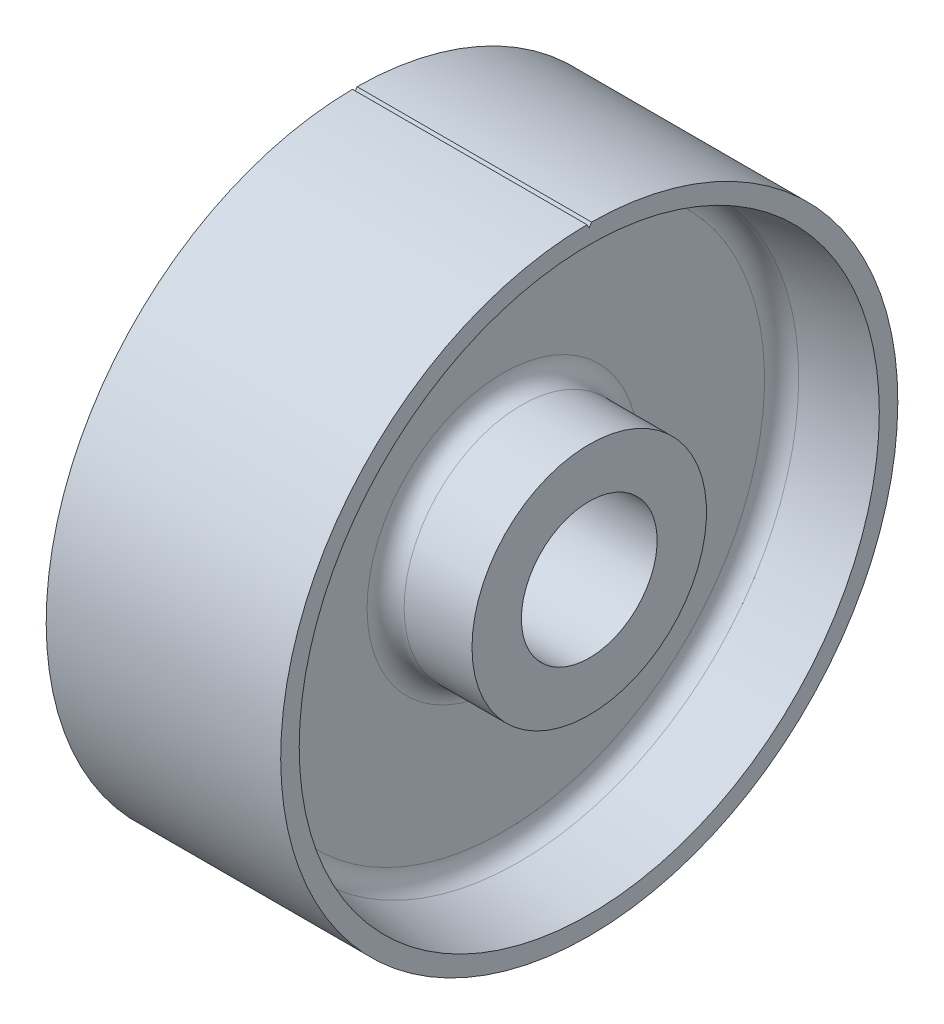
ISO-10303-21;
HEADER;
FILE_DESCRIPTION(('STEP AP214'),'2;1');
FILE_NAME('part.step','',(''),(''),'','','');
FILE_SCHEMA(('AUTOMOTIVE_DESIGN { 1 0 10303 214 1 1 1 1 }'));
ENDSEC;
DATA;
#1=APPLICATION_CONTEXT('core data for automotive mechanical design processes');
#2=APPLICATION_PROTOCOL_DEFINITION('international standard','automotive_design',2000,#1);
#3=PRODUCT_CONTEXT('',#1,'mechanical');
#4=PRODUCT('Part','Part','',(#3));
#5=PRODUCT_RELATED_PRODUCT_CATEGORY('part','',(#4));
#6=PRODUCT_DEFINITION_FORMATION('','',#4);
#7=PRODUCT_DEFINITION_CONTEXT('part definition',#1,'design');
#8=PRODUCT_DEFINITION('design','',#6,#7);
#9=PRODUCT_DEFINITION_SHAPE('','',#8);
#10=(LENGTH_UNIT() NAMED_UNIT(*) SI_UNIT(.MILLI.,.METRE.));
#11=(NAMED_UNIT(*) PLANE_ANGLE_UNIT() SI_UNIT($,.RADIAN.));
#12=(NAMED_UNIT(*) SI_UNIT($,.STERADIAN.) SOLID_ANGLE_UNIT());
#13=UNCERTAINTY_MEASURE_WITH_UNIT(LENGTH_MEASURE(1.E-05),#10,'distance_accuracy_value','');
#14=(GEOMETRIC_REPRESENTATION_CONTEXT(3) GLOBAL_UNCERTAINTY_ASSIGNED_CONTEXT((#13)) GLOBAL_UNIT_ASSIGNED_CONTEXT((#10,
#11,#12)) REPRESENTATION_CONTEXT('',''));
#15=CARTESIAN_POINT('',(0.,0.,0.));
#16=DIRECTION('',(0.,0.,1.));
#17=DIRECTION('',(1.,0.,0.));
#18=AXIS2_PLACEMENT_3D('',#15,#16,#17);
#19=CARTESIAN_POINT('',(-30.6658536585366,0.,0.));
#20=DIRECTION('',(-1.,0.,0.));
#21=DIRECTION('',(0.,0.,1.));
#22=AXIS2_PLACEMENT_3D('',#19,#20,#21);
#23=CYLINDRICAL_SURFACE('',#22,19.);
#24=CARTESIAN_POINT('',(8.00000000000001,0.,0.));
#25=DIRECTION('',(-1.,0.,0.));
#26=DIRECTION('',(0.,0.,1.));
#27=AXIS2_PLACEMENT_3D('',#24,#25,#26);
#28=CIRCLE('',#27,19.);
#29=CARTESIAN_POINT('',(8.00000000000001,0.,19.));
#30=VERTEX_POINT('',#29);
#31=EDGE_CURVE('E39',#30,#30,#28,.F.);
#32=ORIENTED_EDGE('',*,*,#31,.T.);
#33=EDGE_LOOP('',(#32));
#34=FACE_BOUND('',#33,.T.);
#35=CARTESIAN_POINT('',(19.,0.,0.));
#36=DIRECTION('',(-1.,0.,0.));
#37=DIRECTION('',(0.,0.,1.));
#38=AXIS2_PLACEMENT_3D('',#35,#36,#37);
#39=CIRCLE('',#38,19.);
#40=CARTESIAN_POINT('',(19.,0.,19.));
#41=VERTEX_POINT('',#40);
#42=EDGE_CURVE('E103',#41,#41,#39,.T.);
#43=ORIENTED_EDGE('',*,*,#42,.T.);
#44=EDGE_LOOP('',(#43));
#45=FACE_BOUND('',#44,.T.);
#46=ADVANCED_FACE('F32',(#34,#45),#23,.T.);
#47=CARTESIAN_POINT('',(19.,11.,0.));
#48=DIRECTION('',(-1.,0.,0.));
#49=DIRECTION('',(0.,0.,1.));
#50=AXIS2_PLACEMENT_3D('',#47,#48,#49);
#51=PLANE('',#50);
#52=ORIENTED_EDGE('',*,*,#42,.F.);
#53=EDGE_LOOP('',(#52));
#54=FACE_BOUND('',#53,.T.);
#55=CARTESIAN_POINT('',(19.,0.,0.));
#56=DIRECTION('',(-1.,0.,0.));
#57=DIRECTION('',(0.,0.,1.));
#58=AXIS2_PLACEMENT_3D('',#55,#56,#57);
#59=CIRCLE('',#58,11.);
#60=CARTESIAN_POINT('',(19.,0.,11.));
#61=VERTEX_POINT('',#60);
#62=EDGE_CURVE('E100',#61,#61,#59,.T.);
#63=ORIENTED_EDGE('',*,*,#62,.T.);
#64=EDGE_LOOP('',(#63));
#65=FACE_BOUND('',#64,.T.);
#66=ADVANCED_FACE('F155',(#54,#65),#51,.F.);
#67=CARTESIAN_POINT('',(-30.6658536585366,0.,0.));
#68=DIRECTION('',(-1.,0.,0.));
#69=DIRECTION('',(0.,0.,1.));
#70=AXIS2_PLACEMENT_3D('',#67,#68,#69);
#71=CYLINDRICAL_SURFACE('',#70,11.);
#72=ORIENTED_EDGE('',*,*,#62,.F.);
#73=EDGE_LOOP('',(#72));
#74=FACE_BOUND('',#73,.T.);
#75=CARTESIAN_POINT('',(-19.,0.,0.));
#76=DIRECTION('',(-1.,0.,0.));
#77=DIRECTION('',(0.,0.,1.));
#78=AXIS2_PLACEMENT_3D('',#75,#76,#77);
#79=CIRCLE('',#78,11.);
#80=CARTESIAN_POINT('',(-19.,0.,11.));
#81=VERTEX_POINT('',#80);
#82=EDGE_CURVE('E97',#81,#81,#79,.T.);
#83=ORIENTED_EDGE('',*,*,#82,.T.);
#84=EDGE_LOOP('',(#83));
#85=FACE_BOUND('',#84,.T.);
#86=ADVANCED_FACE('F159',(#74,#85),#71,.F.);
#87=CARTESIAN_POINT('',(-19.,11.,0.));
#88=DIRECTION('',(1.,0.,0.));
#89=DIRECTION('',(0.,0.,-1.));
#90=AXIS2_PLACEMENT_3D('',#87,#88,#89);
#91=PLANE('',#90);
#92=ORIENTED_EDGE('',*,*,#82,.F.);
#93=EDGE_LOOP('',(#92));
#94=FACE_BOUND('',#93,.T.);
#95=CARTESIAN_POINT('',(-19.,0.,0.));
#96=DIRECTION('',(-1.,0.,0.));
#97=DIRECTION('',(0.,0.,1.));
#98=AXIS2_PLACEMENT_3D('',#95,#96,#97);
#99=CIRCLE('',#98,19.);
#100=CARTESIAN_POINT('',(-19.,0.,19.));
#101=VERTEX_POINT('',#100);
#102=EDGE_CURVE('E94',#101,#101,#99,.T.);
#103=ORIENTED_EDGE('',*,*,#102,.T.);
#104=EDGE_LOOP('',(#103));
#105=FACE_BOUND('',#104,.T.);
#106=ADVANCED_FACE('F164',(#94,#105),#91,.F.);
#107=CARTESIAN_POINT('',(-30.6658536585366,0.,0.));
#108=DIRECTION('',(-1.,0.,0.));
#109=DIRECTION('',(0.,0.,1.));
#110=AXIS2_PLACEMENT_3D('',#107,#108,#109);
#111=CYLINDRICAL_SURFACE('',#110,19.);
#112=CARTESIAN_POINT('',(-8.,0.,0.));
#113=DIRECTION('',(1.,0.,0.));
#114=DIRECTION('',(0.,0.,-1.));
#115=AXIS2_PLACEMENT_3D('',#112,#113,#114);
#116=CIRCLE('',#115,19.);
#117=CARTESIAN_POINT('',(-8.,0.,-19.));
#118=VERTEX_POINT('',#117);
#119=EDGE_CURVE('E124',#118,#118,#116,.F.);
#120=ORIENTED_EDGE('',*,*,#119,.T.);
#121=EDGE_LOOP('',(#120));
#122=FACE_BOUND('',#121,.T.);
#123=ORIENTED_EDGE('',*,*,#102,.F.);
#124=EDGE_LOOP('',(#123));
#125=FACE_BOUND('',#124,.T.);
#126=ADVANCED_FACE('F172',(#122,#125),#111,.T.);
#127=CARTESIAN_POINT('',(-5.,19.,0.));
#128=DIRECTION('',(1.,0.,0.));
#129=DIRECTION('',(0.,0.,-1.));
#130=AXIS2_PLACEMENT_3D('',#127,#128,#129);
#131=PLANE('',#130);
#132=CARTESIAN_POINT('',(-5.,0.,0.));
#133=DIRECTION('',(1.,0.,0.));
#134=DIRECTION('',(0.,0.,-1.));
#135=AXIS2_PLACEMENT_3D('',#132,#133,#134);
#136=CIRCLE('',#135,42.3981137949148);
#137=CARTESIAN_POINT('',(-5.,0.,-42.3981137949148));
#138=VERTEX_POINT('',#137);
#139=EDGE_CURVE('E109',#138,#138,#136,.F.);
#140=ORIENTED_EDGE('',*,*,#139,.T.);
#141=EDGE_LOOP('',(#140));
#142=FACE_BOUND('',#141,.T.);
#143=CARTESIAN_POINT('',(-5.,0.,0.));
#144=DIRECTION('',(1.,0.,0.));
#145=DIRECTION('',(0.,0.,-1.));
#146=AXIS2_PLACEMENT_3D('',#143,#144,#145);
#147=CIRCLE('',#146,22.);
#148=CARTESIAN_POINT('',(-5.,0.,-22.));
#149=VERTEX_POINT('',#148);
#150=EDGE_CURVE('E106',#149,#149,#147,.T.);
#151=ORIENTED_EDGE('',*,*,#150,.T.);
#152=EDGE_LOOP('',(#151));
#153=FACE_BOUND('',#152,.T.);
#154=ADVANCED_FACE('F176',(#142,#153),#131,.F.);
#155=CARTESIAN_POINT('',(-19.,0.,0.));
#156=DIRECTION('',(-1.,0.,0.));
#157=DIRECTION('',(0.,0.,1.));
#158=AXIS2_PLACEMENT_3D('',#155,#156,#157);
#159=CONICAL_SURFACE('',#158,47.,0.141897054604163);
#160=CARTESIAN_POINT('',(-7.57573593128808,0.,0.));
#161=DIRECTION('',(-1.,0.,0.));
#162=DIRECTION('',(0.,0.,1.));
#163=AXIS2_PLACEMENT_3D('',#160,#161,#162);
#164=CIRCLE('',#163,45.3679622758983);
#165=CARTESIAN_POINT('',(-7.57573593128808,0.,45.3679622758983));
#166=VERTEX_POINT('',#165);
#167=EDGE_CURVE('E112',#166,#166,#164,.F.);
#168=ORIENTED_EDGE('',*,*,#167,.T.);
#169=EDGE_LOOP('',(#168));
#170=FACE_BOUND('',#169,.T.);
#171=CARTESIAN_POINT('',(-19.,0.,0.));
#172=DIRECTION('',(-1.,0.,0.));
#173=DIRECTION('',(0.,0.,1.));
#174=AXIS2_PLACEMENT_3D('',#171,#172,#173);
#175=CIRCLE('',#174,47.);
#176=CARTESIAN_POINT('',(-19.,0.,47.));
#177=VERTEX_POINT('',#176);
#178=EDGE_CURVE('E91',#177,#177,#175,.T.);
#179=ORIENTED_EDGE('',*,*,#178,.T.);
#180=EDGE_LOOP('',(#179));
#181=FACE_BOUND('',#180,.T.);
#182=ADVANCED_FACE('F180',(#170,#181),#159,.F.);
#183=CARTESIAN_POINT('',(-19.,47.,0.));
#184=DIRECTION('',(1.,0.,0.));
#185=DIRECTION('',(0.,0.,-1.));
#186=AXIS2_PLACEMENT_3D('',#183,#184,#185);
#187=PLANE('',#186);
#188=ORIENTED_EDGE('',*,*,#178,.F.);
#189=EDGE_LOOP('',(#188));
#190=FACE_BOUND('',#189,.T.);
#191=DIRECTION('',(0.,-0.866025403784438,-0.500000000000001));
#192=VECTOR('',#191,1.);
#193=CARTESIAN_POINT('',(-19.,49.3634743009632,0.));
#194=LINE('',#193,#192);
#195=CARTESIAN_POINT('',(-19.,49.9986551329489,0.366721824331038));
#196=VERTEX_POINT('',#195);
#197=CARTESIAN_POINT('',(-19.,49.3634743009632,0.));
#198=VERTEX_POINT('',#197);
#199=EDGE_CURVE('E67',#196,#198,#194,.T.);
#200=ORIENTED_EDGE('',*,*,#199,.T.);
#201=DIRECTION('',(0.,0.866025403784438,-0.500000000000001));
#202=VECTOR('',#201,1.);
#203=CARTESIAN_POINT('',(-19.,50.9456023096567,-0.913442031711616));
#204=LINE('',#203,#202);
#205=CARTESIAN_POINT('',(-19.,49.9986551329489,-0.366721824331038));
#206=VERTEX_POINT('',#205);
#207=EDGE_CURVE('E70',#198,#206,#204,.T.);
#208=ORIENTED_EDGE('',*,*,#207,.T.);
#209=CARTESIAN_POINT('',(-19.,0.,0.));
#210=DIRECTION('',(-1.,0.,0.));
#211=DIRECTION('',(0.,0.,1.));
#212=AXIS2_PLACEMENT_3D('',#209,#210,#211);
#213=CIRCLE('',#212,50.);
#214=EDGE_CURVE('E78',#206,#196,#213,.T.);
#215=ORIENTED_EDGE('',*,*,#214,.T.);
#216=EDGE_LOOP('',(#200,#208,#215));
#217=FACE_BOUND('',#216,.T.);
#218=ADVANCED_FACE('F77',(#190,#217),#187,.F.);
#219=CARTESIAN_POINT('',(-30.6658536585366,0.,0.));
#220=DIRECTION('',(-1.,0.,0.));
#221=DIRECTION('',(0.,0.,1.));
#222=AXIS2_PLACEMENT_3D('',#219,#220,#221);
#223=CYLINDRICAL_SURFACE('',#222,50.);
#224=ORIENTED_EDGE('',*,*,#214,.F.);
#225=DIRECTION('',(-1.,0.,0.));
#226=VECTOR('',#225,1.);
#227=CARTESIAN_POINT('',(-30.6658536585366,49.9986551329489,-0.366721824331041));
#228=LINE('',#227,#226);
#229=CARTESIAN_POINT('',(19.,49.9986551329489,-0.366721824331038));
#230=VERTEX_POINT('',#229);
#231=EDGE_CURVE('E53',#206,#230,#228,.F.);
#232=ORIENTED_EDGE('',*,*,#231,.T.);
#233=CARTESIAN_POINT('',(19.,0.,0.));
#234=DIRECTION('',(-1.,0.,0.));
#235=DIRECTION('',(0.,0.,1.));
#236=AXIS2_PLACEMENT_3D('',#233,#234,#235);
#237=CIRCLE('',#236,50.);
#238=CARTESIAN_POINT('',(19.,49.9986551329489,0.366721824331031));
#239=VERTEX_POINT('',#238);
#240=EDGE_CURVE('E87',#230,#239,#237,.T.);
#241=ORIENTED_EDGE('',*,*,#240,.T.);
#242=DIRECTION('',(-1.,0.,0.));
#243=VECTOR('',#242,1.);
#244=CARTESIAN_POINT('',(-30.6658536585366,49.9986551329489,0.366721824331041));
#245=LINE('',#244,#243);
#246=EDGE_CURVE('E46',#239,#196,#245,.T.);
#247=ORIENTED_EDGE('',*,*,#246,.T.);
#248=EDGE_LOOP('',(#224,#232,#241,#247));
#249=FACE_BOUND('',#248,.T.);
#250=ADVANCED_FACE('F187',(#249),#223,.T.);
#251=CARTESIAN_POINT('',(19.,47.,0.));
#252=DIRECTION('',(-1.,0.,0.));
#253=DIRECTION('',(0.,0.,1.));
#254=AXIS2_PLACEMENT_3D('',#251,#252,#253);
#255=PLANE('',#254);
#256=ORIENTED_EDGE('',*,*,#240,.F.);
#257=DIRECTION('',(0.,0.866025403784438,-0.500000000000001));
#258=VECTOR('',#257,1.);
#259=CARTESIAN_POINT('',(19.,50.9456023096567,-0.913442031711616));
#260=LINE('',#259,#258);
#261=CARTESIAN_POINT('',(19.,49.3634743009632,0.));
#262=VERTEX_POINT('',#261);
#263=EDGE_CURVE('E75',#262,#230,#260,.T.);
#264=ORIENTED_EDGE('',*,*,#263,.F.);
#265=DIRECTION('',(0.,0.866025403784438,0.500000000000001));
#266=VECTOR('',#265,1.);
#267=CARTESIAN_POINT('',(19.,47.5908685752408,-1.02341439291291));
#268=LINE('',#267,#266);
#269=EDGE_CURVE('E11',#262,#239,#268,.T.);
#270=ORIENTED_EDGE('',*,*,#269,.T.);
#271=EDGE_LOOP('',(#256,#264,#270));
#272=FACE_BOUND('',#271,.T.);
#273=CARTESIAN_POINT('',(19.,0.,0.));
#274=DIRECTION('',(-1.,0.,0.));
#275=DIRECTION('',(0.,0.,1.));
#276=AXIS2_PLACEMENT_3D('',#273,#274,#275);
#277=CIRCLE('',#276,47.);
#278=CARTESIAN_POINT('',(19.,0.,47.));
#279=VERTEX_POINT('',#278);
#280=EDGE_CURVE('E84',#279,#279,#277,.T.);
#281=ORIENTED_EDGE('',*,*,#280,.T.);
#282=EDGE_LOOP('',(#281));
#283=FACE_BOUND('',#282,.T.);
#284=ADVANCED_FACE('F151',(#272,#283),#255,.F.);
#285=CARTESIAN_POINT('',(5.,0.,0.));
#286=DIRECTION('',(1.,0.,0.));
#287=DIRECTION('',(0.,0.,-1.));
#288=AXIS2_PLACEMENT_3D('',#285,#286,#287);
#289=CONICAL_SURFACE('',#288,45.,0.141897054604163);
#290=CARTESIAN_POINT('',(7.57573593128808,0.,0.));
#291=DIRECTION('',(1.,0.,0.));
#292=DIRECTION('',(0.,0.,-1.));
#293=AXIS2_PLACEMENT_3D('',#290,#291,#292);
#294=CIRCLE('',#293,45.3679622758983);
#295=CARTESIAN_POINT('',(7.57573593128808,0.,-45.3679622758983));
#296=VERTEX_POINT('',#295);
#297=EDGE_CURVE('E115',#296,#296,#294,.F.);
#298=ORIENTED_EDGE('',*,*,#297,.T.);
#299=EDGE_LOOP('',(#298));
#300=FACE_BOUND('',#299,.T.);
#301=ORIENTED_EDGE('',*,*,#280,.F.);
#302=EDGE_LOOP('',(#301));
#303=FACE_BOUND('',#302,.T.);
#304=ADVANCED_FACE('F141',(#300,#303),#289,.F.);
#305=CARTESIAN_POINT('',(5.,19.,0.));
#306=DIRECTION('',(-1.,0.,0.));
#307=DIRECTION('',(0.,0.,1.));
#308=AXIS2_PLACEMENT_3D('',#305,#306,#307);
#309=PLANE('',#308);
#310=CARTESIAN_POINT('',(5.,0.,0.));
#311=DIRECTION('',(-1.,0.,0.));
#312=DIRECTION('',(0.,0.,1.));
#313=AXIS2_PLACEMENT_3D('',#310,#311,#312);
#314=CIRCLE('',#313,42.3981137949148);
#315=CARTESIAN_POINT('',(5.,0.,42.3981137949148));
#316=VERTEX_POINT('',#315);
#317=EDGE_CURVE('E121',#316,#316,#314,.F.);
#318=ORIENTED_EDGE('',*,*,#317,.T.);
#319=EDGE_LOOP('',(#318));
#320=FACE_BOUND('',#319,.T.);
#321=CARTESIAN_POINT('',(5.,0.,0.));
#322=DIRECTION('',(-1.,0.,0.));
#323=DIRECTION('',(0.,0.,1.));
#324=AXIS2_PLACEMENT_3D('',#321,#322,#323);
#325=CIRCLE('',#324,22.);
#326=CARTESIAN_POINT('',(5.,0.,22.));
#327=VERTEX_POINT('',#326);
#328=EDGE_CURVE('E118',#327,#327,#325,.T.);
#329=ORIENTED_EDGE('',*,*,#328,.T.);
#330=EDGE_LOOP('',(#329));
#331=FACE_BOUND('',#330,.T.);
#332=ADVANCED_FACE('F138',(#320,#331),#309,.F.);
#333=CARTESIAN_POINT('',(-8.,0.,0.));
#334=DIRECTION('',(1.,0.,0.));
#335=DIRECTION('',(0.,0.,-1.));
#336=AXIS2_PLACEMENT_3D('',#333,#334,#335);
#337=TOROIDAL_SURFACE('',#336,42.3981137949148,3.);
#338=ORIENTED_EDGE('',*,*,#167,.F.);
#339=EDGE_LOOP('',(#338));
#340=FACE_BOUND('',#339,.T.);
#341=ORIENTED_EDGE('',*,*,#139,.F.);
#342=EDGE_LOOP('',(#341));
#343=FACE_BOUND('',#342,.T.);
#344=ADVANCED_FACE('F140',(#340,#343),#337,.F.);
#345=CARTESIAN_POINT('',(8.,0.,0.));
#346=DIRECTION('',(-1.,0.,0.));
#347=DIRECTION('',(0.,0.,1.));
#348=AXIS2_PLACEMENT_3D('',#345,#346,#347);
#349=TOROIDAL_SURFACE('',#348,42.3981137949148,3.);
#350=ORIENTED_EDGE('',*,*,#317,.F.);
#351=EDGE_LOOP('',(#350));
#352=FACE_BOUND('',#351,.T.);
#353=ORIENTED_EDGE('',*,*,#297,.F.);
#354=EDGE_LOOP('',(#353));
#355=FACE_BOUND('',#354,.T.);
#356=ADVANCED_FACE('F148',(#352,#355),#349,.F.);
#357=CARTESIAN_POINT('',(-8.,0.,0.));
#358=DIRECTION('',(1.,0.,0.));
#359=DIRECTION('',(0.,0.,-1.));
#360=AXIS2_PLACEMENT_3D('',#357,#358,#359);
#361=TOROIDAL_SURFACE('',#360,22.,3.);
#362=ORIENTED_EDGE('',*,*,#150,.F.);
#363=EDGE_LOOP('',(#362));
#364=FACE_BOUND('',#363,.T.);
#365=ORIENTED_EDGE('',*,*,#119,.F.);
#366=EDGE_LOOP('',(#365));
#367=FACE_BOUND('',#366,.T.);
#368=ADVANCED_FACE('F134',(#364,#367),#361,.F.);
#369=CARTESIAN_POINT('',(8.00000000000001,0.,0.));
#370=DIRECTION('',(-1.,0.,0.));
#371=DIRECTION('',(0.,0.,1.));
#372=AXIS2_PLACEMENT_3D('',#369,#370,#371);
#373=TOROIDAL_SURFACE('',#372,22.,3.);
#374=ORIENTED_EDGE('',*,*,#31,.F.);
#375=EDGE_LOOP('',(#374));
#376=FACE_BOUND('',#375,.T.);
#377=ORIENTED_EDGE('',*,*,#328,.F.);
#378=EDGE_LOOP('',(#377));
#379=FACE_BOUND('',#378,.T.);
#380=ADVANCED_FACE('F131',(#376,#379),#373,.F.);
#381=CARTESIAN_POINT('',(-19.,50.9456023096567,-0.913442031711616));
#382=DIRECTION('',(0.,-0.500000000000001,-0.866025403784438));
#383=DIRECTION('',(0.,0.866025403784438,-0.500000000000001));
#384=AXIS2_PLACEMENT_3D('',#381,#382,#383);
#385=PLANE('',#384);
#386=ORIENTED_EDGE('',*,*,#207,.F.);
#387=DIRECTION('',(1.,0.,0.));
#388=VECTOR('',#387,1.);
#389=CARTESIAN_POINT('',(-19.,49.3634743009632,0.));
#390=LINE('',#389,#388);
#391=EDGE_CURVE('E64',#198,#262,#390,.T.);
#392=ORIENTED_EDGE('',*,*,#391,.T.);
#393=ORIENTED_EDGE('',*,*,#263,.T.);
#394=ORIENTED_EDGE('',*,*,#231,.F.);
#395=EDGE_LOOP('',(#386,#392,#393,#394));
#396=FACE_BOUND('',#395,.T.);
#397=ADVANCED_FACE('F71',(#396),#385,.F.);
#398=CARTESIAN_POINT('',(-19.,49.3634743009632,0.));
#399=DIRECTION('',(0.,-0.500000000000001,0.866025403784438));
#400=DIRECTION('',(0.,-0.866025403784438,-0.500000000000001));
#401=AXIS2_PLACEMENT_3D('',#398,#399,#400);
#402=PLANE('',#401);
#403=ORIENTED_EDGE('',*,*,#269,.F.);
#404=ORIENTED_EDGE('',*,*,#391,.F.);
#405=ORIENTED_EDGE('',*,*,#199,.F.);
#406=ORIENTED_EDGE('',*,*,#246,.F.);
#407=EDGE_LOOP('',(#403,#404,#405,#406));
#408=FACE_BOUND('',#407,.T.);
#409=ADVANCED_FACE('F65',(#408),#402,.F.);
#410=CLOSED_SHELL('',(#46,#66,#86,#106,#126,#154,#182,#218,#250,#284,#304,#332,#344,#356,#368,
#380,#397,#409));
#411=MANIFOLD_SOLID_BREP('B2',#410);
#412=ADVANCED_BREP_SHAPE_REPRESENTATION('',(#18,#411),#14);
#413=SHAPE_DEFINITION_REPRESENTATION(#9,#412);
ENDSEC;
END-ISO-10303-21;
